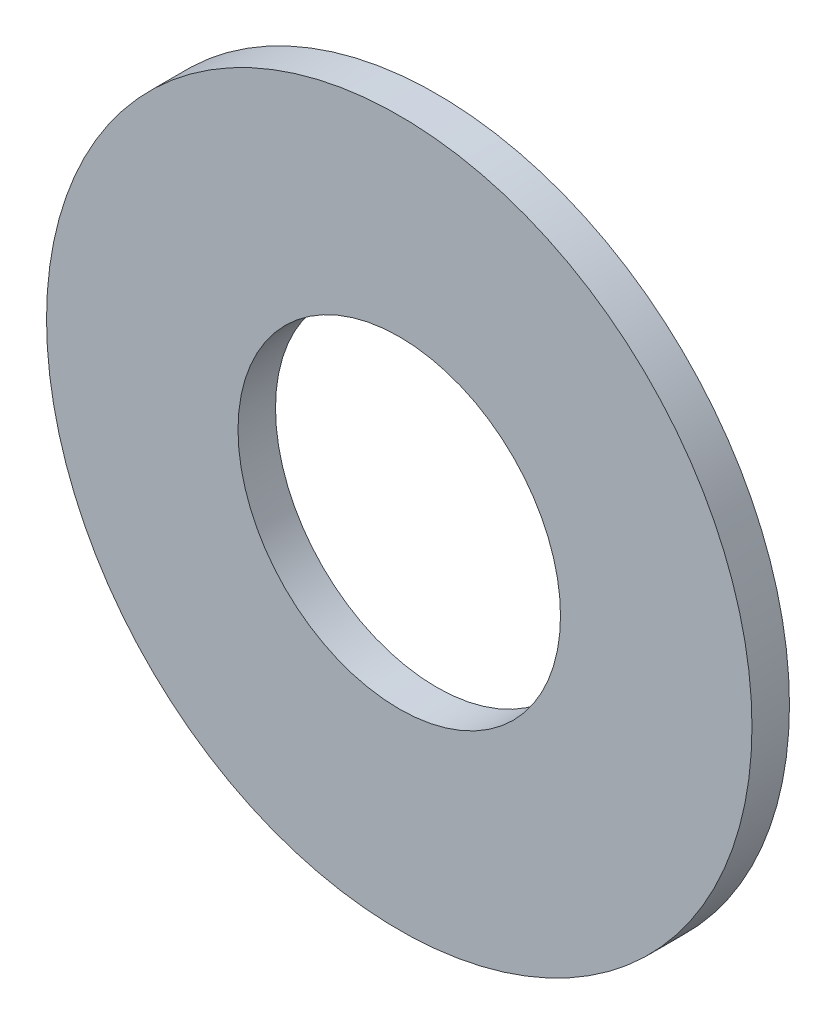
from build123d import *

# Parameters (mm, degrees)
SKETCH1_R          = 11.1125
SKETCH1_R_2        = 5.08
BASE_EXTRUDE_DEPTH = 1.1811


with BuildPart() as part:
    # Sketch1 → Base-Extrude (new body)
    with BuildSketch(Plane.XY):
        Circle(SKETCH1_R)
        Circle(SKETCH1_R_2, mode=Mode.SUBTRACT)
    extrude(amount=-BASE_EXTRUDE_DEPTH)


solid = part.part
